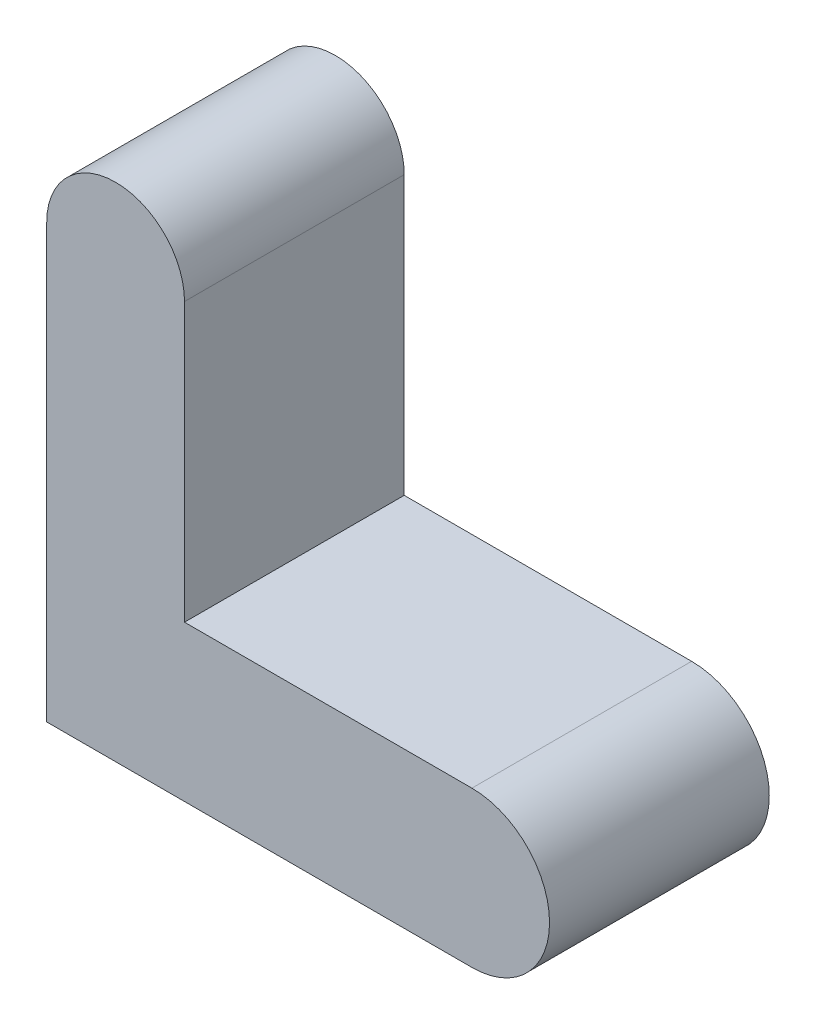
from build123d import *

# Parameters (mm, degrees)
BOSS_EXTRUDE2_START = 50
BOSS_EXTRUDE2_DEPTH = 55


with BuildPart() as part:
    # Sketch1 → Boss-Extrude2 (new body)
    with BuildSketch(Plane.XY.offset(BOSS_EXTRUDE2_START)):
        with BuildLine():
            Line((-61.303638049, -19.434884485), (45.12628912, -19.434884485))
            ThreePointArc((45.12628912, -19.434884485), (64.561173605, 0), (45.12628912, 19.434884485))
            Line((45.12628912, 19.434884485), (-26.820341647, 19.434884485))
            Line((-26.820341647, 19.434884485), (-26.820341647, 88.954375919))
            ThreePointArc((-26.820341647, 88.954375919), (-44.061989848, 106.196024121), (-61.303638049, 88.954375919))
            Line((-61.303638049, 88.954375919), (-61.303638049, -19.434884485))
        make_face()
    extrude(amount=BOSS_EXTRUDE2_DEPTH)


solid = part.part
